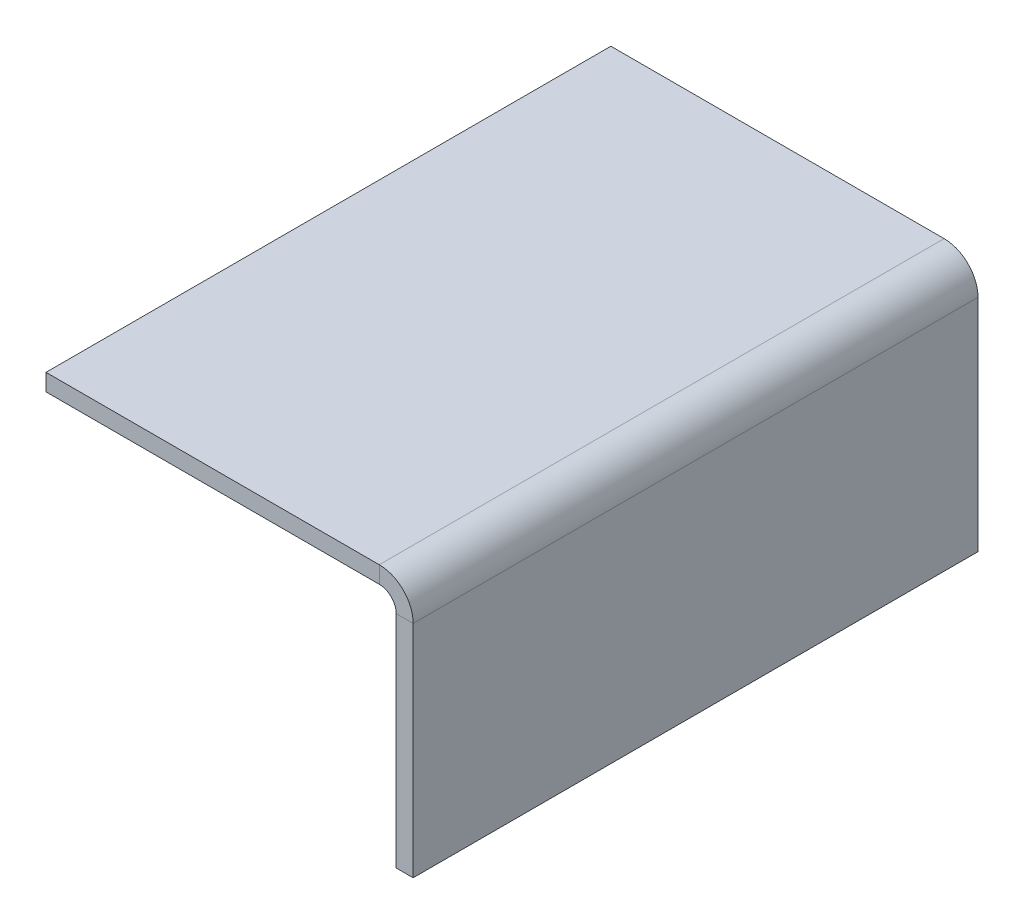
ISO-10303-21;
HEADER;
FILE_DESCRIPTION(('STEP AP214'),'2;1');
FILE_NAME('part.step','',(''),(''),'','','');
FILE_SCHEMA(('AUTOMOTIVE_DESIGN { 1 0 10303 214 1 1 1 1 }'));
ENDSEC;
DATA;
#1=APPLICATION_CONTEXT('core data for automotive mechanical design processes');
#2=APPLICATION_PROTOCOL_DEFINITION('international standard','automotive_design',2000,#1);
#3=PRODUCT_CONTEXT('',#1,'mechanical');
#4=PRODUCT('Part','Part','',(#3));
#5=PRODUCT_RELATED_PRODUCT_CATEGORY('part','',(#4));
#6=PRODUCT_DEFINITION_FORMATION('','',#4);
#7=PRODUCT_DEFINITION_CONTEXT('part definition',#1,'design');
#8=PRODUCT_DEFINITION('design','',#6,#7);
#9=PRODUCT_DEFINITION_SHAPE('','',#8);
#10=(LENGTH_UNIT() NAMED_UNIT(*) SI_UNIT(.MILLI.,.METRE.));
#11=(NAMED_UNIT(*) PLANE_ANGLE_UNIT() SI_UNIT($,.RADIAN.));
#12=(NAMED_UNIT(*) SI_UNIT($,.STERADIAN.) SOLID_ANGLE_UNIT());
#13=UNCERTAINTY_MEASURE_WITH_UNIT(LENGTH_MEASURE(1.E-05),#10,'distance_accuracy_value','');
#14=(GEOMETRIC_REPRESENTATION_CONTEXT(3) GLOBAL_UNCERTAINTY_ASSIGNED_CONTEXT((#13)) GLOBAL_UNIT_ASSIGNED_CONTEXT((#10,
#11,#12)) REPRESENTATION_CONTEXT('',''));
#15=CARTESIAN_POINT('',(0.,0.,0.));
#16=DIRECTION('',(0.,0.,1.));
#17=DIRECTION('',(1.,0.,0.));
#18=AXIS2_PLACEMENT_3D('',#15,#16,#17);
#19=CARTESIAN_POINT('',(-1.52655665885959E-13,-2.99999999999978,24.9999999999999));
#20=DIRECTION('',(0.,0.,1.));
#21=DIRECTION('',(0.999999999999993,0.,0.));
#22=AXIS2_PLACEMENT_3D('',#19,#20,#21);
#23=PLANE('',#22);
#24=DIRECTION('',(-0.999999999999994,0.,0.));
#25=VECTOR('',#24,1.);
#26=CARTESIAN_POINT('',(-1.52655665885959E-13,-2.99999999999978,24.9999999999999));
#27=LINE('',#26,#25);
#28=CARTESIAN_POINT('',(-1.52655665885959E-13,-2.99999999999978,24.9999999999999));
#29=VERTEX_POINT('',#28);
#30=CARTESIAN_POINT('',(-1.49999999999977,-2.99999999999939,24.9999999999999));
#31=VERTEX_POINT('',#30);
#32=EDGE_CURVE('E11',#29,#31,#27,.T.);
#33=ORIENTED_EDGE('',*,*,#32,.F.);
#34=CARTESIAN_POINT('',(-2.9999999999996,-2.99999999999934,24.9999999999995));
#35=DIRECTION('',(0.,0.,1.));
#36=DIRECTION('',(0.999999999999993,0.,0.));
#37=AXIS2_PLACEMENT_3D('',#34,#35,#36);
#38=CIRCLE('',#37,3.);
#39=CARTESIAN_POINT('',(-2.99999999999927,6.66133814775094E-13,25.0000000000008));
#40=VERTEX_POINT('',#39);
#41=EDGE_CURVE('E162',#40,#29,#38,.F.);
#42=ORIENTED_EDGE('',*,*,#41,.F.);
#43=DIRECTION('',(0.,0.99999999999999,0.));
#44=VECTOR('',#43,1.);
#45=CARTESIAN_POINT('',(-2.99999999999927,-1.50000000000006,25.0000000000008));
#46=LINE('',#45,#44);
#47=CARTESIAN_POINT('',(-2.99999999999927,-1.50000000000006,25.0000000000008));
#48=VERTEX_POINT('',#47);
#49=EDGE_CURVE('E46',#48,#40,#46,.T.);
#50=ORIENTED_EDGE('',*,*,#49,.F.);
#51=CARTESIAN_POINT('',(-2.9999999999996,-2.99999999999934,24.9999999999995));
#52=DIRECTION('',(0.,0.,1.));
#53=DIRECTION('',(0.999999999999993,0.,0.));
#54=AXIS2_PLACEMENT_3D('',#51,#52,#53);
#55=CIRCLE('',#54,1.5);
#56=EDGE_CURVE('E177',#48,#31,#55,.F.);
#57=ORIENTED_EDGE('',*,*,#56,.T.);
#58=EDGE_LOOP('',(#33,#42,#50,#57));
#59=FACE_BOUND('',#58,.T.);
#60=ADVANCED_FACE('F38',(#59),#23,.T.);
#61=CARTESIAN_POINT('',(-2.99999999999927,-1.50000000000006,25.0000000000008));
#62=DIRECTION('',(0.,0.,1.));
#63=DIRECTION('',(0.999999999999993,0.,0.));
#64=AXIS2_PLACEMENT_3D('',#61,#62,#63);
#65=PLANE('',#64);
#66=DIRECTION('',(0.,-0.999999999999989,0.));
#67=VECTOR('',#66,1.);
#68=CARTESIAN_POINT('',(6.80011602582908E-13,-2.22044604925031E-13,25.0000000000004));
#69=LINE('',#68,#67);
#70=CARTESIAN_POINT('',(1.80411241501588E-13,-22.499999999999,25.0000000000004));
#71=VERTEX_POINT('',#70);
#72=EDGE_CURVE('E158',#29,#71,#69,.T.);
#73=ORIENTED_EDGE('',*,*,#72,.F.);
#74=ORIENTED_EDGE('',*,*,#32,.T.);
#75=DIRECTION('',(0.,-0.999999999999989,0.));
#76=VECTOR('',#75,1.);
#77=CARTESIAN_POINT('',(-1.49999999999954,0.,25.0000000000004));
#78=LINE('',#77,#76);
#79=CARTESIAN_POINT('',(-1.49999999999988,-22.4999999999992,24.9999999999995));
#80=VERTEX_POINT('',#79);
#81=EDGE_CURVE('E153',#31,#80,#78,.T.);
#82=ORIENTED_EDGE('',*,*,#81,.T.);
#83=DIRECTION('',(-0.999999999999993,0.,0.));
#84=VECTOR('',#83,1.);
#85=CARTESIAN_POINT('',(1.80411241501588E-13,-22.499999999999,25.0000000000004));
#86=LINE('',#85,#84);
#87=EDGE_CURVE('E108',#71,#80,#86,.T.);
#88=ORIENTED_EDGE('',*,*,#87,.F.);
#89=EDGE_LOOP('',(#73,#74,#82,#88));
#90=FACE_BOUND('',#89,.T.);
#91=ADVANCED_FACE('F230',(#90),#65,.T.);
#92=CARTESIAN_POINT('',(-2.99999999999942,1.11022302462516E-12,-24.9999999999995));
#93=DIRECTION('',(0.,0.,-1.));
#94=DIRECTION('',(-0.999999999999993,0.,0.));
#95=AXIS2_PLACEMENT_3D('',#92,#93,#94);
#96=PLANE('',#95);
#97=DIRECTION('',(0.,-0.99999999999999,0.));
#98=VECTOR('',#97,1.);
#99=CARTESIAN_POINT('',(-2.99999999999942,1.11022302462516E-12,-24.9999999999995));
#100=LINE('',#99,#98);
#101=CARTESIAN_POINT('',(-2.99999999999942,1.11022302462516E-12,-24.9999999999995));
#102=VERTEX_POINT('',#101);
#103=CARTESIAN_POINT('',(-2.99999999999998,-1.49999999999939,-25.0000000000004));
#104=VERTEX_POINT('',#103);
#105=EDGE_CURVE('E203',#102,#104,#100,.T.);
#106=ORIENTED_EDGE('',*,*,#105,.F.);
#107=CARTESIAN_POINT('',(-2.99999999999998,-2.99999999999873,-25.0000000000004));
#108=DIRECTION('',(0.,0.,1.));
#109=DIRECTION('',(0.999999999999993,0.,0.));
#110=AXIS2_PLACEMENT_3D('',#107,#108,#109);
#111=CIRCLE('',#110,3.);
#112=CARTESIAN_POINT('',(-5.27355936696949E-13,-2.99999999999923,-25.0000000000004));
#113=VERTEX_POINT('',#112);
#114=EDGE_CURVE('E132',#102,#113,#111,.F.);
#115=ORIENTED_EDGE('',*,*,#114,.T.);
#116=DIRECTION('',(0.999999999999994,0.,0.));
#117=VECTOR('',#116,1.);
#118=CARTESIAN_POINT('',(-1.4999999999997,-2.99999999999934,-24.9999999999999));
#119=LINE('',#118,#117);
#120=CARTESIAN_POINT('',(-1.4999999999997,-2.99999999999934,-24.9999999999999));
#121=VERTEX_POINT('',#120);
#122=EDGE_CURVE('E112',#121,#113,#119,.T.);
#123=ORIENTED_EDGE('',*,*,#122,.F.);
#124=CARTESIAN_POINT('',(-2.99999999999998,-2.99999999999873,-25.0000000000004));
#125=DIRECTION('',(0.,0.,1.));
#126=DIRECTION('',(0.999999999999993,0.,0.));
#127=AXIS2_PLACEMENT_3D('',#124,#125,#126);
#128=CIRCLE('',#127,1.5);
#129=EDGE_CURVE('E149',#104,#121,#128,.F.);
#130=ORIENTED_EDGE('',*,*,#129,.F.);
#131=EDGE_LOOP('',(#106,#115,#123,#130));
#132=FACE_BOUND('',#131,.T.);
#133=ADVANCED_FACE('F234',(#132),#96,.T.);
#134=CARTESIAN_POINT('',(-1.4999999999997,-2.99999999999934,-24.9999999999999));
#135=DIRECTION('',(0.,0.,-1.));
#136=DIRECTION('',(-0.999999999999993,0.,0.));
#137=AXIS2_PLACEMENT_3D('',#134,#135,#136);
#138=PLANE('',#137);
#139=DIRECTION('',(0.999999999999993,0.,0.));
#140=VECTOR('',#139,1.);
#141=CARTESIAN_POINT('',(-32.4999999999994,8.88178419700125E-13,-24.9999999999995));
#142=LINE('',#141,#140);
#143=CARTESIAN_POINT('',(-32.4999999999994,8.88178419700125E-13,-24.9999999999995));
#144=VERTEX_POINT('',#143);
#145=EDGE_CURVE('E137',#144,#102,#142,.T.);
#146=ORIENTED_EDGE('',*,*,#145,.T.);
#147=ORIENTED_EDGE('',*,*,#105,.T.);
#148=DIRECTION('',(0.999999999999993,0.,0.));
#149=VECTOR('',#148,1.);
#150=CARTESIAN_POINT('',(-32.4999999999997,-1.49999999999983,-25.0000000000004));
#151=LINE('',#150,#149);
#152=CARTESIAN_POINT('',(-32.4999999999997,-1.49999999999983,-25.0000000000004));
#153=VERTEX_POINT('',#152);
#154=EDGE_CURVE('E145',#153,#104,#151,.T.);
#155=ORIENTED_EDGE('',*,*,#154,.F.);
#156=DIRECTION('',(0.,0.99999999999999,0.));
#157=VECTOR('',#156,1.);
#158=CARTESIAN_POINT('',(-32.4999999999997,-1.49999999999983,-25.0000000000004));
#159=LINE('',#158,#157);
#160=EDGE_CURVE('E141',#153,#144,#159,.T.);
#161=ORIENTED_EDGE('',*,*,#160,.T.);
#162=EDGE_LOOP('',(#146,#147,#155,#161));
#163=FACE_BOUND('',#162,.T.);
#164=ADVANCED_FACE('F236',(#163),#138,.T.);
#165=CARTESIAN_POINT('',(-1.49999999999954,0.,25.0000000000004));
#166=DIRECTION('',(0.999999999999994,0.,0.));
#167=DIRECTION('',(0.,0.999999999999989,0.));
#168=AXIS2_PLACEMENT_3D('',#165,#166,#167);
#169=PLANE('',#168);
#170=DIRECTION('',(0.,-0.999999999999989,0.));
#171=VECTOR('',#170,1.);
#172=CARTESIAN_POINT('',(-1.50000000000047,6.66133814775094E-13,-25.0000000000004));
#173=LINE('',#172,#171);
#174=CARTESIAN_POINT('',(-1.49999999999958,-22.4999999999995,-24.9999999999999));
#175=VERTEX_POINT('',#174);
#176=EDGE_CURVE('E117',#121,#175,#173,.T.);
#177=ORIENTED_EDGE('',*,*,#176,.T.);
#178=DIRECTION('',(0.,0.,-1.));
#179=VECTOR('',#178,1.);
#180=CARTESIAN_POINT('',(-1.49999999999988,-22.4999999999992,24.9999999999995));
#181=LINE('',#180,#179);
#182=EDGE_CURVE('E101',#80,#175,#181,.T.);
#183=ORIENTED_EDGE('',*,*,#182,.F.);
#184=ORIENTED_EDGE('',*,*,#81,.F.);
#185=DIRECTION('',(0.,0.,-1.));
#186=VECTOR('',#185,1.);
#187=CARTESIAN_POINT('',(-1.49999999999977,-2.99999999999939,24.9999999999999));
#188=LINE('',#187,#186);
#189=EDGE_CURVE('E120',#31,#121,#188,.T.);
#190=ORIENTED_EDGE('',*,*,#189,.T.);
#191=EDGE_LOOP('',(#177,#183,#184,#190));
#192=FACE_BOUND('',#191,.T.);
#193=ADVANCED_FACE('F118',(#192),#169,.F.);
#194=CARTESIAN_POINT('',(1.80411241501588E-13,-22.499999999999,25.0000000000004));
#195=DIRECTION('',(0.,-0.99999999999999,0.));
#196=DIRECTION('',(0.,0.,-1.));
#197=AXIS2_PLACEMENT_3D('',#194,#195,#196);
#198=PLANE('',#197);
#199=DIRECTION('',(-0.999999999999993,0.,0.));
#200=VECTOR('',#199,1.);
#201=CARTESIAN_POINT('',(-7.49400541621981E-13,-22.4999999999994,-25.0000000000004));
#202=LINE('',#201,#200);
#203=CARTESIAN_POINT('',(-7.49400541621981E-13,-22.4999999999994,-25.0000000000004));
#204=VERTEX_POINT('',#203);
#205=EDGE_CURVE('E105',#204,#175,#202,.T.);
#206=ORIENTED_EDGE('',*,*,#205,.F.);
#207=DIRECTION('',(0.,0.,-1.));
#208=VECTOR('',#207,1.);
#209=CARTESIAN_POINT('',(1.80411241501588E-13,-22.499999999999,25.0000000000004));
#210=LINE('',#209,#208);
#211=EDGE_CURVE('E113',#71,#204,#210,.T.);
#212=ORIENTED_EDGE('',*,*,#211,.F.);
#213=ORIENTED_EDGE('',*,*,#87,.T.);
#214=ORIENTED_EDGE('',*,*,#182,.T.);
#215=EDGE_LOOP('',(#206,#212,#213,#214));
#216=FACE_BOUND('',#215,.T.);
#217=ADVANCED_FACE('F103',(#216),#198,.T.);
#218=CARTESIAN_POINT('',(6.80011602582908E-13,-2.22044604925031E-13,25.0000000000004));
#219=DIRECTION('',(0.999999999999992,0.,0.));
#220=DIRECTION('',(0.,0.999999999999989,0.));
#221=AXIS2_PLACEMENT_3D('',#218,#219,#220);
#222=PLANE('',#221);
#223=DIRECTION('',(0.,-0.999999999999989,0.));
#224=VECTOR('',#223,1.);
#225=CARTESIAN_POINT('',(-7.49400541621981E-13,5.55111512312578E-13,-25.0000000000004));
#226=LINE('',#225,#224);
#227=EDGE_CURVE('E126',#113,#204,#226,.T.);
#228=ORIENTED_EDGE('',*,*,#227,.F.);
#229=DIRECTION('',(0.,0.,-1.));
#230=VECTOR('',#229,1.);
#231=CARTESIAN_POINT('',(-1.52655665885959E-13,-2.99999999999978,24.9999999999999));
#232=LINE('',#231,#230);
#233=EDGE_CURVE('E195',#29,#113,#232,.T.);
#234=ORIENTED_EDGE('',*,*,#233,.F.);
#235=ORIENTED_EDGE('',*,*,#72,.T.);
#236=ORIENTED_EDGE('',*,*,#211,.T.);
#237=EDGE_LOOP('',(#228,#234,#235,#236));
#238=FACE_BOUND('',#237,.T.);
#239=ADVANCED_FACE('F232',(#238),#222,.T.);
#240=CARTESIAN_POINT('',(-2.9999999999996,-2.99999999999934,24.9999999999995));
#241=DIRECTION('',(0.,0.,-1.));
#242=DIRECTION('',(-0.999999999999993,0.,0.));
#243=AXIS2_PLACEMENT_3D('',#240,#241,#242);
#244=CYLINDRICAL_SURFACE('',#243,3.);
#245=ORIENTED_EDGE('',*,*,#114,.F.);
#246=DIRECTION('',(0.,0.,-1.));
#247=VECTOR('',#246,1.);
#248=CARTESIAN_POINT('',(-2.99999999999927,6.66133814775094E-13,25.0000000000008));
#249=LINE('',#248,#247);
#250=EDGE_CURVE('E191',#40,#102,#249,.T.);
#251=ORIENTED_EDGE('',*,*,#250,.F.);
#252=ORIENTED_EDGE('',*,*,#41,.T.);
#253=ORIENTED_EDGE('',*,*,#233,.T.);
#254=EDGE_LOOP('',(#245,#251,#252,#253));
#255=FACE_BOUND('',#254,.T.);
#256=ADVANCED_FACE('F215',(#255),#244,.T.);
#257=CARTESIAN_POINT('',(-32.5000000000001,3.33066907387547E-13,25.0000000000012));
#258=DIRECTION('',(0.,0.99999999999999,0.));
#259=DIRECTION('',(0.,0.,1.));
#260=AXIS2_PLACEMENT_3D('',#257,#258,#259);
#261=PLANE('',#260);
#262=ORIENTED_EDGE('',*,*,#145,.F.);
#263=DIRECTION('',(0.,0.,-1.));
#264=VECTOR('',#263,1.);
#265=CARTESIAN_POINT('',(-32.5000000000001,3.33066907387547E-13,25.0000000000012));
#266=LINE('',#265,#264);
#267=CARTESIAN_POINT('',(-32.5000000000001,3.33066907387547E-13,25.0000000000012));
#268=VERTEX_POINT('',#267);
#269=EDGE_CURVE('E189',#268,#144,#266,.T.);
#270=ORIENTED_EDGE('',*,*,#269,.F.);
#271=DIRECTION('',(0.999999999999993,0.,0.));
#272=VECTOR('',#271,1.);
#273=CARTESIAN_POINT('',(-32.5000000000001,3.33066907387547E-13,25.0000000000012));
#274=LINE('',#273,#272);
#275=EDGE_CURVE('E166',#268,#40,#274,.T.);
#276=ORIENTED_EDGE('',*,*,#275,.T.);
#277=ORIENTED_EDGE('',*,*,#250,.T.);
#278=EDGE_LOOP('',(#262,#270,#276,#277));
#279=FACE_BOUND('',#278,.T.);
#280=ADVANCED_FACE('F219',(#279),#261,.T.);
#281=CARTESIAN_POINT('',(-32.5000000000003,-1.49999999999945,25.0000000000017));
#282=DIRECTION('',(-0.999999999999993,0.,0.));
#283=DIRECTION('',(0.,0.,1.));
#284=AXIS2_PLACEMENT_3D('',#281,#282,#283);
#285=PLANE('',#284);
#286=ORIENTED_EDGE('',*,*,#160,.F.);
#287=DIRECTION('',(0.,0.,-1.));
#288=VECTOR('',#287,1.);
#289=CARTESIAN_POINT('',(-32.5000000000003,-1.49999999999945,25.0000000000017));
#290=LINE('',#289,#288);
#291=CARTESIAN_POINT('',(-32.5000000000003,-1.49999999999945,25.0000000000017));
#292=VERTEX_POINT('',#291);
#293=EDGE_CURVE('E186',#292,#153,#290,.T.);
#294=ORIENTED_EDGE('',*,*,#293,.F.);
#295=DIRECTION('',(0.,0.99999999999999,0.));
#296=VECTOR('',#295,1.);
#297=CARTESIAN_POINT('',(-32.5000000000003,-1.49999999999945,25.0000000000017));
#298=LINE('',#297,#296);
#299=EDGE_CURVE('E170',#292,#268,#298,.T.);
#300=ORIENTED_EDGE('',*,*,#299,.T.);
#301=ORIENTED_EDGE('',*,*,#269,.T.);
#302=EDGE_LOOP('',(#286,#294,#300,#301));
#303=FACE_BOUND('',#302,.T.);
#304=ADVANCED_FACE('F222',(#303),#285,.T.);
#305=CARTESIAN_POINT('',(-32.5000000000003,-1.49999999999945,25.0000000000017));
#306=DIRECTION('',(0.,0.99999999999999,0.));
#307=DIRECTION('',(0.,0.,1.));
#308=AXIS2_PLACEMENT_3D('',#305,#306,#307);
#309=PLANE('',#308);
#310=ORIENTED_EDGE('',*,*,#154,.T.);
#311=DIRECTION('',(0.,0.,-1.));
#312=VECTOR('',#311,1.);
#313=CARTESIAN_POINT('',(-2.99999999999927,-1.50000000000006,25.0000000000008));
#314=LINE('',#313,#312);
#315=EDGE_CURVE('E182',#48,#104,#314,.T.);
#316=ORIENTED_EDGE('',*,*,#315,.F.);
#317=DIRECTION('',(0.999999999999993,0.,0.));
#318=VECTOR('',#317,1.);
#319=CARTESIAN_POINT('',(-32.5000000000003,-1.49999999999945,25.0000000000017));
#320=LINE('',#319,#318);
#321=EDGE_CURVE('E174',#292,#48,#320,.T.);
#322=ORIENTED_EDGE('',*,*,#321,.F.);
#323=ORIENTED_EDGE('',*,*,#293,.T.);
#324=EDGE_LOOP('',(#310,#316,#322,#323));
#325=FACE_BOUND('',#324,.T.);
#326=ADVANCED_FACE('F225',(#325),#309,.F.);
#327=CARTESIAN_POINT('',(-2.9999999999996,-2.99999999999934,24.9999999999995));
#328=DIRECTION('',(0.,0.,-1.));
#329=DIRECTION('',(-0.999999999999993,0.,0.));
#330=AXIS2_PLACEMENT_3D('',#327,#328,#329);
#331=CYLINDRICAL_SURFACE('',#330,1.5);
#332=ORIENTED_EDGE('',*,*,#129,.T.);
#333=ORIENTED_EDGE('',*,*,#189,.F.);
#334=ORIENTED_EDGE('',*,*,#56,.F.);
#335=ORIENTED_EDGE('',*,*,#315,.T.);
#336=EDGE_LOOP('',(#332,#333,#334,#335));
#337=FACE_BOUND('',#336,.T.);
#338=ADVANCED_FACE('F229',(#337),#331,.F.);
#339=CARTESIAN_POINT('',(-2.9999999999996,-2.99999999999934,24.9999999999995));
#340=DIRECTION('',(0.,0.,1.));
#341=DIRECTION('',(0.999999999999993,0.,0.));
#342=AXIS2_PLACEMENT_3D('',#339,#340,#341);
#343=PLANE('',#342);
#344=ORIENTED_EDGE('',*,*,#321,.T.);
#345=ORIENTED_EDGE('',*,*,#49,.T.);
#346=ORIENTED_EDGE('',*,*,#275,.F.);
#347=ORIENTED_EDGE('',*,*,#299,.F.);
#348=EDGE_LOOP('',(#344,#345,#346,#347));
#349=FACE_BOUND('',#348,.T.);
#350=ADVANCED_FACE('F209',(#349),#343,.T.);
#351=CARTESIAN_POINT('',(-2.99999999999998,-2.99999999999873,-25.0000000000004));
#352=DIRECTION('',(0.,0.,1.));
#353=DIRECTION('',(0.999999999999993,0.,0.));
#354=AXIS2_PLACEMENT_3D('',#351,#352,#353);
#355=PLANE('',#354);
#356=ORIENTED_EDGE('',*,*,#176,.F.);
#357=ORIENTED_EDGE('',*,*,#122,.T.);
#358=ORIENTED_EDGE('',*,*,#227,.T.);
#359=ORIENTED_EDGE('',*,*,#205,.T.);
#360=EDGE_LOOP('',(#356,#357,#358,#359));
#361=FACE_BOUND('',#360,.T.);
#362=ADVANCED_FACE('F124',(#361),#355,.F.);
#363=CLOSED_SHELL('',(#60,#91,#133,#164,#193,#217,#239,#256,#280,#304,#326,#338,#350,#362));
#364=MANIFOLD_SOLID_BREP('B2',#363);
#365=ADVANCED_BREP_SHAPE_REPRESENTATION('',(#18,#364),#14);
#366=SHAPE_DEFINITION_REPRESENTATION(#9,#365);
ENDSEC;
END-ISO-10303-21;
